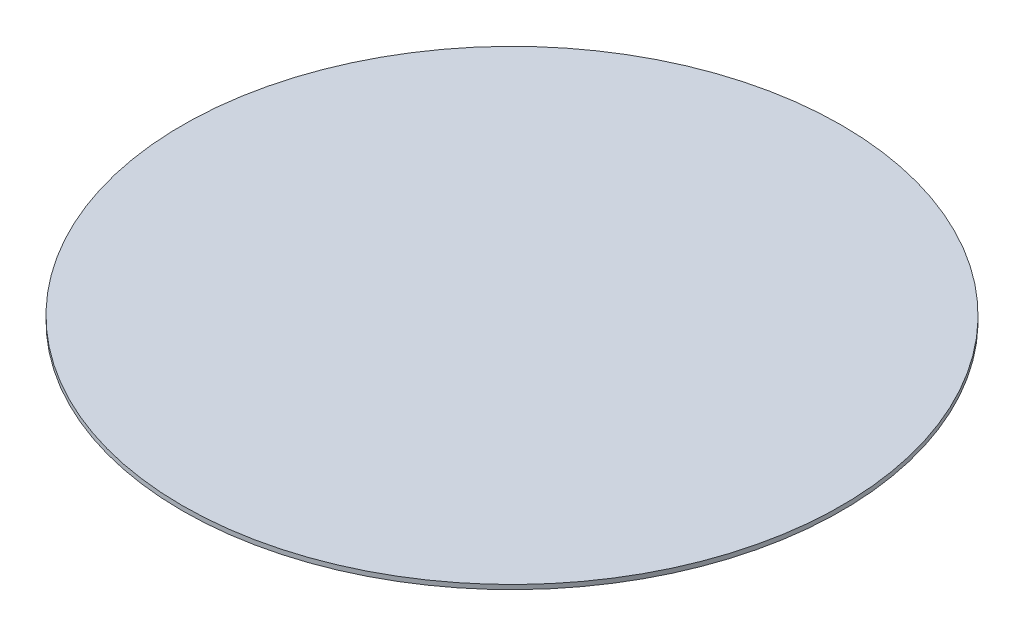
ISO-10303-21;
HEADER;
FILE_DESCRIPTION(('STEP AP214'),'2;1');
FILE_NAME('part.step','',(''),(''),'','','');
FILE_SCHEMA(('AUTOMOTIVE_DESIGN { 1 0 10303 214 1 1 1 1 }'));
ENDSEC;
DATA;
#1=APPLICATION_CONTEXT('core data for automotive mechanical design processes');
#2=APPLICATION_PROTOCOL_DEFINITION('international standard','automotive_design',2000,#1);
#3=PRODUCT_CONTEXT('',#1,'mechanical');
#4=PRODUCT('Part','Part','',(#3));
#5=PRODUCT_RELATED_PRODUCT_CATEGORY('part','',(#4));
#6=PRODUCT_DEFINITION_FORMATION('','',#4);
#7=PRODUCT_DEFINITION_CONTEXT('part definition',#1,'design');
#8=PRODUCT_DEFINITION('design','',#6,#7);
#9=PRODUCT_DEFINITION_SHAPE('','',#8);
#10=(LENGTH_UNIT() NAMED_UNIT(*) SI_UNIT(.MILLI.,.METRE.));
#11=(NAMED_UNIT(*) PLANE_ANGLE_UNIT() SI_UNIT($,.RADIAN.));
#12=(NAMED_UNIT(*) SI_UNIT($,.STERADIAN.) SOLID_ANGLE_UNIT());
#13=UNCERTAINTY_MEASURE_WITH_UNIT(LENGTH_MEASURE(1.E-05),#10,'distance_accuracy_value','');
#14=(GEOMETRIC_REPRESENTATION_CONTEXT(3) GLOBAL_UNCERTAINTY_ASSIGNED_CONTEXT((#13)) GLOBAL_UNIT_ASSIGNED_CONTEXT((#10,
#11,#12)) REPRESENTATION_CONTEXT('',''));
#15=CARTESIAN_POINT('',(0.,0.,0.));
#16=DIRECTION('',(0.,0.,1.));
#17=DIRECTION('',(1.,0.,0.));
#18=AXIS2_PLACEMENT_3D('',#15,#16,#17);
#19=CARTESIAN_POINT('',(0.,2.,0.));
#20=DIRECTION('',(0.,-1.,0.));
#21=DIRECTION('',(0.,0.,-1.));
#22=AXIS2_PLACEMENT_3D('',#19,#20,#21);
#23=CYLINDRICAL_SURFACE('',#22,147.);
#24=CARTESIAN_POINT('',(0.,2.,0.));
#25=DIRECTION('',(0.,1.,0.));
#26=DIRECTION('',(0.,0.,1.));
#27=AXIS2_PLACEMENT_3D('',#24,#25,#26);
#28=CIRCLE('',#27,147.);
#29=CARTESIAN_POINT('',(0.,2.,147.));
#30=VERTEX_POINT('',#29);
#31=EDGE_CURVE('E10',#30,#30,#28,.T.);
#32=ORIENTED_EDGE('',*,*,#31,.F.);
#33=EDGE_LOOP('',(#32));
#34=FACE_BOUND('',#33,.T.);
#35=CARTESIAN_POINT('',(0.,0.,0.));
#36=DIRECTION('',(0.,1.,0.));
#37=DIRECTION('',(0.,0.,1.));
#38=AXIS2_PLACEMENT_3D('',#35,#36,#37);
#39=CIRCLE('',#38,147.);
#40=CARTESIAN_POINT('',(0.,0.,147.));
#41=VERTEX_POINT('',#40);
#42=EDGE_CURVE('E40',#41,#41,#39,.T.);
#43=ORIENTED_EDGE('',*,*,#42,.T.);
#44=EDGE_LOOP('',(#43));
#45=FACE_BOUND('',#44,.T.);
#46=ADVANCED_FACE('F37',(#34,#45),#23,.T.);
#47=CARTESIAN_POINT('',(0.,2.,0.));
#48=DIRECTION('',(0.,1.,0.));
#49=DIRECTION('',(0.,0.,1.));
#50=AXIS2_PLACEMENT_3D('',#47,#48,#49);
#51=PLANE('',#50);
#52=ORIENTED_EDGE('',*,*,#31,.T.);
#53=EDGE_LOOP('',(#52));
#54=FACE_BOUND('',#53,.T.);
#55=ADVANCED_FACE('F54',(#54),#51,.T.);
#56=CARTESIAN_POINT('',(0.,0.,0.));
#57=DIRECTION('',(0.,1.,0.));
#58=DIRECTION('',(0.,0.,1.));
#59=AXIS2_PLACEMENT_3D('',#56,#57,#58);
#60=PLANE('',#59);
#61=ORIENTED_EDGE('',*,*,#42,.F.);
#62=EDGE_LOOP('',(#61));
#63=FACE_BOUND('',#62,.T.);
#64=ADVANCED_FACE('F52',(#63),#60,.F.);
#65=CLOSED_SHELL('',(#46,#55,#64));
#66=MANIFOLD_SOLID_BREP('B2',#65);
#67=ADVANCED_BREP_SHAPE_REPRESENTATION('',(#18,#66),#14);
#68=SHAPE_DEFINITION_REPRESENTATION(#9,#67);
ENDSEC;
END-ISO-10303-21;
